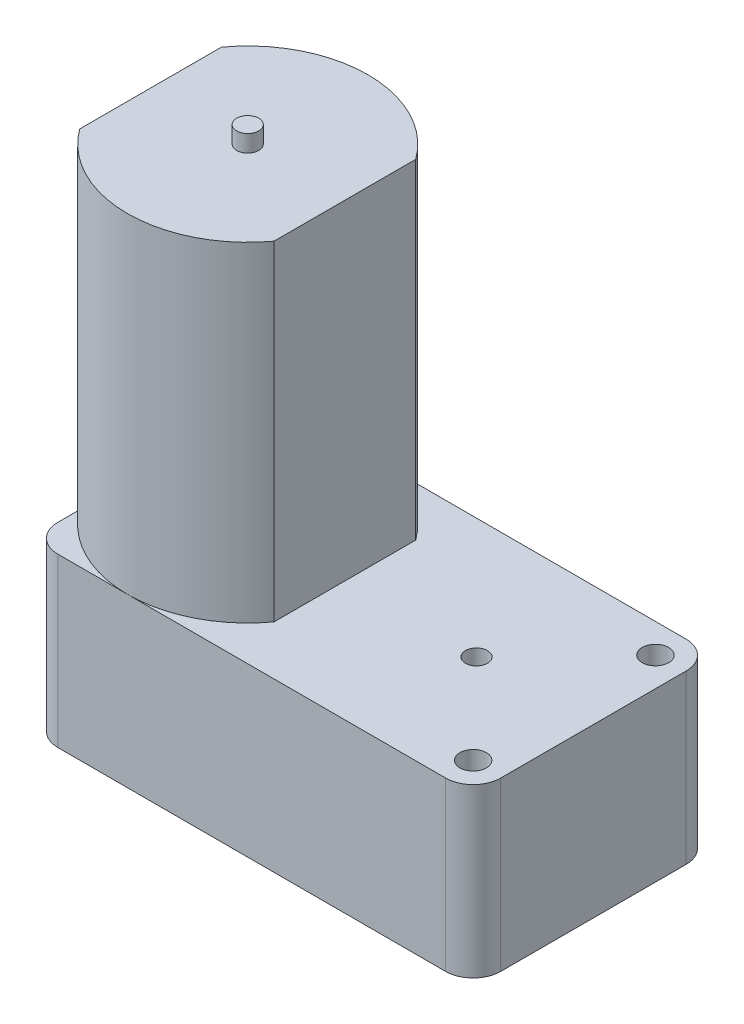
from build123d import *

# Parameters (mm, degrees)
SKETCH1_W           = 41.8
SKETCH1_H           = 22.7
BOSS_EXTRUDE1_DEPTH = 15.81
SKETCH2_R           = 1.25
SKETCH2_R_2         = 1.04
CUT_EXTRUDE1_DEPTH  = 29.558511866
FILLET1_R           = 2.6
SKETCH3_R           = 1.97
BOSS_EXTRUDE2_DEPTH = 1
BOSS_EXTRUDE3_DEPTH = 31.12
SKETCH5_R           = 1.04
BOSS_EXTRUDE4_DEPTH = 1.6


with BuildPart() as part:
    # Sketch1 → Boss-Extrude1 (new body)
    with BuildSketch(Plane(origin=(0, 0, 0), x_dir=(1, 0, 0), z_dir=(0, 1, 0))):
        Rectangle(SKETCH1_W, SKETCH1_H)
    extrude(amount=BOSS_EXTRUDE1_DEPTH)

    # Sketch2 → Cut-Extrude1 (cut, through all)
    with BuildSketch(Plane.XZ):
        with Locations(Location((18.15, 8.6, 0), (0, 0, 270))):
            Circle(SKETCH2_R)
        with Locations(Location((18.15, -8.6, 0), (0, 0, 270))):
            Circle(SKETCH2_R)
        with Locations(Location((9.86, 0, 0), (0, 0, 270))):
            Circle(SKETCH2_R_2)
    extrude(amount=-CUT_EXTRUDE1_DEPTH, mode=Mode.SUBTRACT)

    # Fillet1
    fillet1_edges = [part.edges().sort_by_distance(p)[0] for p in [
        (-20.9, 7.905, -11.35),
        (20.9, 7.905, -11.35),
        (20.9, 7.905, 11.35),
        (-20.9, 7.905, 11.35),
    ]]
    fillet(fillet1_edges, radius=FILLET1_R)

    # Sketch3 → Boss-Extrude2 (add)
    with BuildSketch(Plane.XZ):
        with Locations(Location((-1.39, 0, 0), (0, 0, 90))):
            Circle(SKETCH3_R)
    extrude(amount=BOSS_EXTRUDE2_DEPTH)


with BuildPart() as body_2:
    # Sketch4 → Boss-Extrude3 (new body)
    with BuildSketch(Plane(origin=(0, 15.81, 0), x_dir=(1, 0, 0), z_dir=(0, 1, 0))):
        with BuildLine():
            Line((-20.9, 6.688318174), (-20.9, -6.688318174))
            ThreePointArc((-20.9, -6.688318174), (-11.73, -11.35), (-2.56, -6.688318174))
            Line((-2.56, -6.688318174), (-2.56, 6.688318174))
            ThreePointArc((-2.56, 6.688318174), (-11.73, 11.35), (-20.9, 6.688318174))
        make_face()
    extrude(amount=BOSS_EXTRUDE3_DEPTH)


with BuildPart() as body_3:
    # Sketch5 → Boss-Extrude4 (new body)
    with BuildSketch(Plane(origin=(0, 46.93, 0), x_dir=(-1, 0, 0), z_dir=(0, 1, 0))):
        with Locations(Location((11.73, 0, 0), (0, 0, 90))):
            Circle(SKETCH5_R)
    extrude(amount=BOSS_EXTRUDE4_DEPTH)


solid = Compound([part.part, body_2.part, body_3.part])
